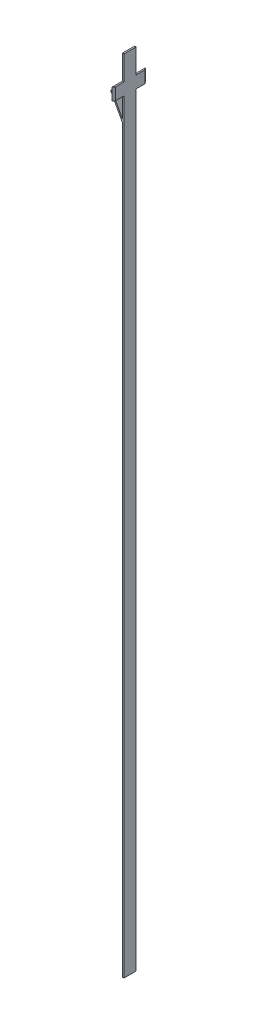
from build123d import *

# Parameters (mm, degrees)
BOSS_EXTRUDE1_DEPTH = 2.5
SKETCH3_W           = 0.61
SKETCH3_H           = 5
BOSS_EXTRUDE2_DEPTH = 18
SKETCH1_OUTSIDE_W   = 73.934
SKETCH1_OUTSIDE_H   = 104.4
SKETCH1_OUTSIDE_R   = 11
CUT_EXTRUDE1_DEPTH  = 331.527224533


with BuildPart() as part:
    # Sketch2 → Boss-Extrude1 (new, symmetric)
    with BuildSketch(Plane.XY):
        Polygon((-4.924038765, -15.868240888), (0, -25), (0, -330), (0.61, -330), (0.61, 0), (0, 0), (0, -15), align=None)
        Polygon((-3.986179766, -16.322281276), (0, -15.619410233), (0, -23.714756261), align=None, mode=Mode.SUBTRACT)
    extrude(amount=BOSS_EXTRUDE1_DEPTH, both=True)

    # Sketch3 → Boss-Extrude2 (add, symmetric)
    with BuildSketch(Plane.XY):
        with Locations((0.305, -12.5)):
            Rectangle(SKETCH3_W, SKETCH3_H)
    extrude(amount=BOSS_EXTRUDE2_DEPTH, both=True)

    # Sketch1 outside → Cut-Extrude1 (cut, through all)
    with BuildSketch(Plane(origin=(0, 0, 0), x_dir=(1, 0, 0), z_dir=(0, 1, 0))):
        with Locations((-2.157, 0)):
            Rectangle(SKETCH1_OUTSIDE_W, SKETCH1_OUTSIDE_H)
        with Locations((-8.56, 0)):
            Circle(SKETCH1_OUTSIDE_R, mode=Mode.SUBTRACT)
    extrude(amount=-CUT_EXTRUDE1_DEPTH, mode=Mode.SUBTRACT)


solid = part.part
